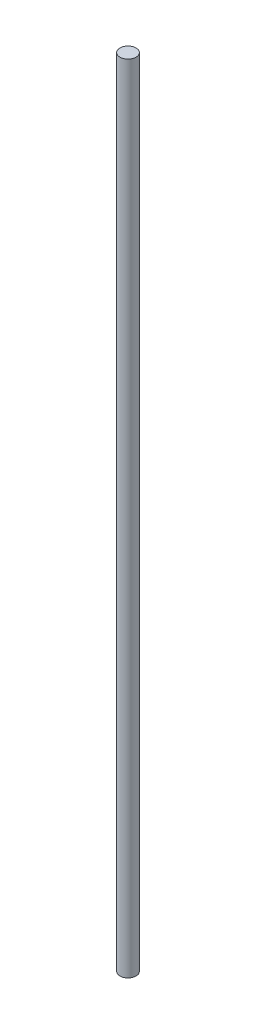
ISO-10303-21;
HEADER;
FILE_DESCRIPTION(('STEP AP214'),'2;1');
FILE_NAME('part.step','',(''),(''),'','','');
FILE_SCHEMA(('AUTOMOTIVE_DESIGN { 1 0 10303 214 1 1 1 1 }'));
ENDSEC;
DATA;
#1=APPLICATION_CONTEXT('core data for automotive mechanical design processes');
#2=APPLICATION_PROTOCOL_DEFINITION('international standard','automotive_design',2000,#1);
#3=PRODUCT_CONTEXT('',#1,'mechanical');
#4=PRODUCT('Part','Part','',(#3));
#5=PRODUCT_RELATED_PRODUCT_CATEGORY('part','',(#4));
#6=PRODUCT_DEFINITION_FORMATION('','',#4);
#7=PRODUCT_DEFINITION_CONTEXT('part definition',#1,'design');
#8=PRODUCT_DEFINITION('design','',#6,#7);
#9=PRODUCT_DEFINITION_SHAPE('','',#8);
#10=(LENGTH_UNIT() NAMED_UNIT(*) SI_UNIT(.MILLI.,.METRE.));
#11=(NAMED_UNIT(*) PLANE_ANGLE_UNIT() SI_UNIT($,.RADIAN.));
#12=(NAMED_UNIT(*) SI_UNIT($,.STERADIAN.) SOLID_ANGLE_UNIT());
#13=UNCERTAINTY_MEASURE_WITH_UNIT(LENGTH_MEASURE(1.E-05),#10,'distance_accuracy_value','');
#14=(GEOMETRIC_REPRESENTATION_CONTEXT(3) GLOBAL_UNCERTAINTY_ASSIGNED_CONTEXT((#13)) GLOBAL_UNIT_ASSIGNED_CONTEXT((#10,
#11,#12)) REPRESENTATION_CONTEXT('',''));
#15=CARTESIAN_POINT('',(0.,0.,0.));
#16=DIRECTION('',(0.,0.,1.));
#17=DIRECTION('',(1.,0.,0.));
#18=AXIS2_PLACEMENT_3D('',#15,#16,#17);
#19=CARTESIAN_POINT('',(0.,396.63,0.));
#20=DIRECTION('',(0.,1.,0.));
#21=DIRECTION('',(0.,0.,1.));
#22=AXIS2_PLACEMENT_3D('',#19,#20,#21);
#23=PLANE('',#22);
#24=CARTESIAN_POINT('',(0.,396.63,0.));
#25=DIRECTION('',(0.,-1.,0.));
#26=DIRECTION('',(0.,0.,-1.));
#27=AXIS2_PLACEMENT_3D('',#24,#25,#26);
#28=CIRCLE('',#27,4.);
#29=CARTESIAN_POINT('',(0.,396.63,-4.));
#30=VERTEX_POINT('',#29);
#31=EDGE_CURVE('E18',#30,#30,#28,.T.);
#32=ORIENTED_EDGE('',*,*,#31,.F.);
#33=EDGE_LOOP('',(#32));
#34=FACE_BOUND('',#33,.T.);
#35=ADVANCED_FACE('F15',(#34),#23,.T.);
#36=CARTESIAN_POINT('',(0.,0.,0.));
#37=DIRECTION('',(0.,1.,0.));
#38=DIRECTION('',(0.,0.,1.));
#39=AXIS2_PLACEMENT_3D('',#36,#37,#38);
#40=PLANE('',#39);
#41=CARTESIAN_POINT('',(0.,0.,0.));
#42=DIRECTION('',(0.,-1.,0.));
#43=DIRECTION('',(0.,0.,-1.));
#44=AXIS2_PLACEMENT_3D('',#41,#42,#43);
#45=CIRCLE('',#44,4.);
#46=CARTESIAN_POINT('',(0.,0.,-4.));
#47=VERTEX_POINT('',#46);
#48=EDGE_CURVE('E10',#47,#47,#45,.F.);
#49=ORIENTED_EDGE('',*,*,#48,.F.);
#50=EDGE_LOOP('',(#49));
#51=FACE_BOUND('',#50,.T.);
#52=ADVANCED_FACE('F30',(#51),#40,.F.);
#53=CARTESIAN_POINT('',(0.,396.63,0.));
#54=DIRECTION('',(0.,-1.,0.));
#55=DIRECTION('',(0.,0.,-1.));
#56=AXIS2_PLACEMENT_3D('',#53,#54,#55);
#57=CYLINDRICAL_SURFACE('',#56,4.);
#58=ORIENTED_EDGE('',*,*,#48,.T.);
#59=EDGE_LOOP('',(#58));
#60=FACE_BOUND('',#59,.T.);
#61=ORIENTED_EDGE('',*,*,#31,.T.);
#62=EDGE_LOOP('',(#61));
#63=FACE_BOUND('',#62,.T.);
#64=ADVANCED_FACE('F27',(#60,#63),#57,.T.);
#65=CLOSED_SHELL('',(#35,#52,#64));
#66=MANIFOLD_SOLID_BREP('B1',#65);
#67=ADVANCED_BREP_SHAPE_REPRESENTATION('',(#18,#66),#14);
#68=SHAPE_DEFINITION_REPRESENTATION(#9,#67);
ENDSEC;
END-ISO-10303-21;
